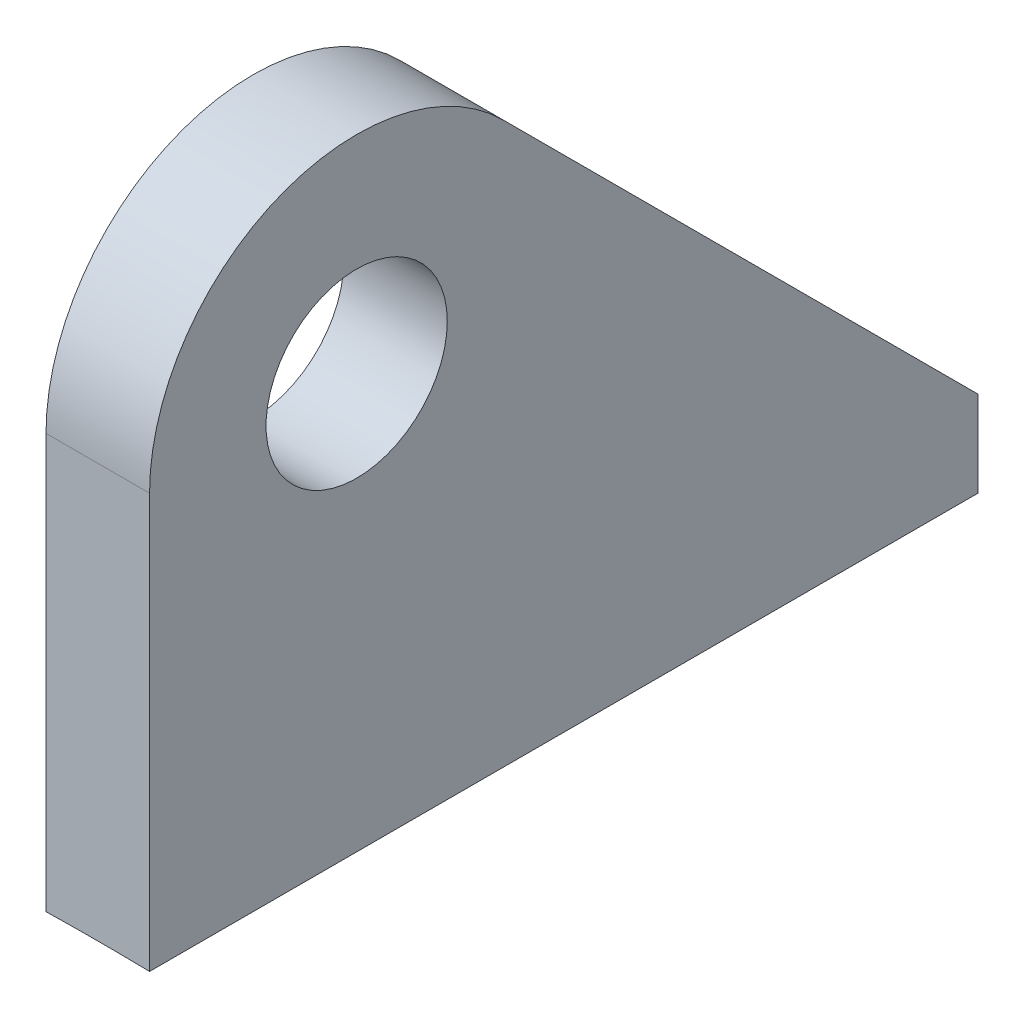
from build123d import *

# Parameters (mm, degrees)
SKETCH2_R           = 22.225
BOSS_EXTRUDE1_DEPTH = 12.7
SKETCH3_R           = 609.6
CUT_EXTRUDE1_DEPTH  = 255.31730181


with BuildPart() as part:
    # Sketch2 → Boss-Extrude1 (new, symmetric)
    with BuildSketch(Plane(origin=(0, 0, 0), x_dir=(0, 0, -1), z_dir=(1, 0, 0))):
        with BuildLine():
            Line((0, 101.6), (0, 0))
            Line((0, 0), (203.2, 0))
            Line((203.2, 0), (203.2, 21.042048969))
            Line((203.2, 21.042048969), (86.721024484, 137.521024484))
            ThreePointArc((86.721024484, 137.521024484), (31.359681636, 148.533080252), (0, 101.6))
        make_face()
        with Locations((50.8, 101.6)):
            Circle(SKETCH2_R, mode=Mode.SUBTRACT)
    extrude(amount=BOSS_EXTRUDE1_DEPTH, both=True)

    # Sketch3 → Cut-Extrude1 (cut, through all)
    with BuildSketch(Plane.XY):
        with Locations((0, -609.467693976)):
            Circle(SKETCH3_R)
    extrude(amount=-CUT_EXTRUDE1_DEPTH, mode=Mode.SUBTRACT)


solid = part.part
